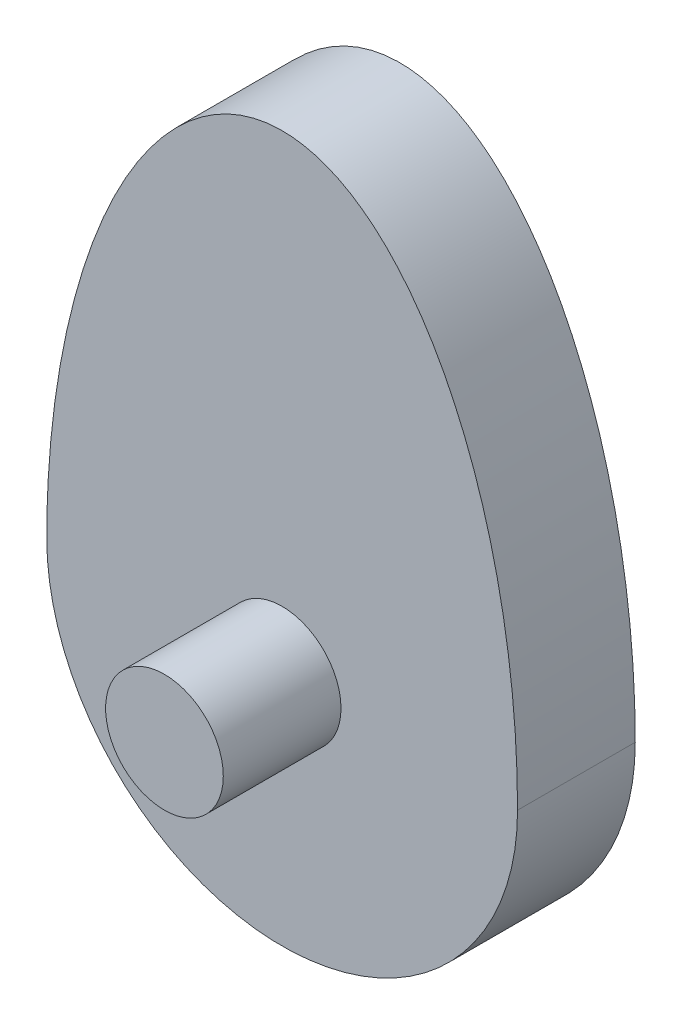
ISO-10303-21;
HEADER;
FILE_DESCRIPTION(('STEP AP214'),'2;1');
FILE_NAME('part.step','',(''),(''),'','','');
FILE_SCHEMA(('AUTOMOTIVE_DESIGN { 1 0 10303 214 1 1 1 1 }'));
ENDSEC;
DATA;
#1=APPLICATION_CONTEXT('core data for automotive mechanical design processes');
#2=APPLICATION_PROTOCOL_DEFINITION('international standard','automotive_design',2000,#1);
#3=PRODUCT_CONTEXT('',#1,'mechanical');
#4=PRODUCT('Part','Part','',(#3));
#5=PRODUCT_RELATED_PRODUCT_CATEGORY('part','',(#4));
#6=PRODUCT_DEFINITION_FORMATION('','',#4);
#7=PRODUCT_DEFINITION_CONTEXT('part definition',#1,'design');
#8=PRODUCT_DEFINITION('design','',#6,#7);
#9=PRODUCT_DEFINITION_SHAPE('','',#8);
#10=(LENGTH_UNIT() NAMED_UNIT(*) SI_UNIT(.MILLI.,.METRE.));
#11=(NAMED_UNIT(*) PLANE_ANGLE_UNIT() SI_UNIT($,.RADIAN.));
#12=(NAMED_UNIT(*) SI_UNIT($,.STERADIAN.) SOLID_ANGLE_UNIT());
#13=UNCERTAINTY_MEASURE_WITH_UNIT(LENGTH_MEASURE(1.E-05),#10,'distance_accuracy_value','');
#14=(GEOMETRIC_REPRESENTATION_CONTEXT(3) GLOBAL_UNCERTAINTY_ASSIGNED_CONTEXT((#13)) GLOBAL_UNIT_ASSIGNED_CONTEXT((#10,
#11,#12)) REPRESENTATION_CONTEXT('',''));
#15=CARTESIAN_POINT('',(0.,0.,0.));
#16=DIRECTION('',(0.,0.,1.));
#17=DIRECTION('',(1.,0.,0.));
#18=AXIS2_PLACEMENT_3D('',#15,#16,#17);
#19=CARTESIAN_POINT('',(0.,0.,20.));
#20=DIRECTION('',(0.,0.,1.));
#21=DIRECTION('',(1.,0.,0.));
#22=AXIS2_PLACEMENT_3D('',#19,#20,#21);
#23=PLANE('',#22);
#24=CARTESIAN_POINT('',(0.,0.,20.));
#25=DIRECTION('',(0.,0.,1.));
#26=DIRECTION('',(0.,1.,0.));
#27=AXIS2_PLACEMENT_3D('',#24,#25,#26);
#28=ELLIPSE('',#27,80.,40.);
#29=CARTESIAN_POINT('',(40.,0.,20.));
#30=VERTEX_POINT('',#29);
#31=CARTESIAN_POINT('',(-40.,0.,20.));
#32=VERTEX_POINT('',#31);
#33=EDGE_CURVE('E67',#30,#32,#28,.T.);
#34=ORIENTED_EDGE('',*,*,#33,.T.);
#35=CARTESIAN_POINT('',(0.,0.,20.));
#36=DIRECTION('',(0.,0.,1.));
#37=DIRECTION('',(1.,0.,0.));
#38=AXIS2_PLACEMENT_3D('',#35,#36,#37);
#39=CIRCLE('',#38,40.);
#40=EDGE_CURVE('E50',#32,#30,#39,.T.);
#41=ORIENTED_EDGE('',*,*,#40,.T.);
#42=EDGE_LOOP('',(#34,#41));
#43=FACE_BOUND('',#42,.T.);
#44=CARTESIAN_POINT('',(0.,0.,20.));
#45=DIRECTION('',(0.,0.,1.));
#46=DIRECTION('',(1.,0.,0.));
#47=AXIS2_PLACEMENT_3D('',#44,#45,#46);
#48=CIRCLE('',#47,10.);
#49=CARTESIAN_POINT('',(10.,0.,20.));
#50=VERTEX_POINT('',#49);
#51=EDGE_CURVE('E76',#50,#50,#48,.T.);
#52=ORIENTED_EDGE('',*,*,#51,.F.);
#53=EDGE_LOOP('',(#52));
#54=FACE_BOUND('',#53,.T.);
#55=ADVANCED_FACE('F33',(#43,#54),#23,.T.);
#56=DIRECTION('',(0.,0.,-1.));
#57=VECTOR('',#56,1.);
#58=SURFACE_OF_LINEAR_EXTRUSION('',#28,#57);
#59=CARTESIAN_POINT('',(0.,0.,0.));
#60=DIRECTION('',(0.,0.,1.));
#61=DIRECTION('',(0.,1.,0.));
#62=AXIS2_PLACEMENT_3D('',#59,#60,#61);
#63=ELLIPSE('',#62,80.,40.);
#64=CARTESIAN_POINT('',(40.,0.,0.));
#65=VERTEX_POINT('',#64);
#66=CARTESIAN_POINT('',(-40.,0.,0.));
#67=VERTEX_POINT('',#66);
#68=EDGE_CURVE('E68',#65,#67,#63,.T.);
#69=ORIENTED_EDGE('',*,*,#68,.T.);
#70=DIRECTION('',(0.,0.,-1.));
#71=VECTOR('',#70,1.);
#72=CARTESIAN_POINT('',(-40.,0.,20.));
#73=LINE('',#72,#71);
#74=EDGE_CURVE('E43',#32,#67,#73,.T.);
#75=ORIENTED_EDGE('',*,*,#74,.F.);
#76=ORIENTED_EDGE('',*,*,#33,.F.);
#77=DIRECTION('',(0.,0.,-1.));
#78=VECTOR('',#77,1.);
#79=CARTESIAN_POINT('',(40.,0.,20.));
#80=LINE('',#79,#78);
#81=EDGE_CURVE('E63',#30,#65,#80,.T.);
#82=ORIENTED_EDGE('',*,*,#81,.T.);
#83=EDGE_LOOP('',(#69,#75,#76,#82));
#84=FACE_BOUND('',#83,.T.);
#85=ADVANCED_FACE('F35',(#84),#58,.F.);
#86=CARTESIAN_POINT('',(0.,0.,20.));
#87=DIRECTION('',(0.,0.,-1.));
#88=DIRECTION('',(-1.,0.,0.));
#89=AXIS2_PLACEMENT_3D('',#86,#87,#88);
#90=CYLINDRICAL_SURFACE('',#89,40.);
#91=CARTESIAN_POINT('',(0.,0.,0.));
#92=DIRECTION('',(0.,0.,1.));
#93=DIRECTION('',(1.,0.,0.));
#94=AXIS2_PLACEMENT_3D('',#91,#92,#93);
#95=CIRCLE('',#94,40.);
#96=EDGE_CURVE('E58',#67,#65,#95,.T.);
#97=ORIENTED_EDGE('',*,*,#96,.T.);
#98=ORIENTED_EDGE('',*,*,#81,.F.);
#99=ORIENTED_EDGE('',*,*,#40,.F.);
#100=ORIENTED_EDGE('',*,*,#74,.T.);
#101=EDGE_LOOP('',(#97,#98,#99,#100));
#102=FACE_BOUND('',#101,.T.);
#103=ADVANCED_FACE('F62',(#102),#90,.T.);
#104=CARTESIAN_POINT('',(0.,0.,0.));
#105=DIRECTION('',(0.,0.,1.));
#106=DIRECTION('',(1.,0.,0.));
#107=AXIS2_PLACEMENT_3D('',#104,#105,#106);
#108=PLANE('',#107);
#109=CARTESIAN_POINT('',(0.,0.,0.));
#110=DIRECTION('',(0.,0.,1.));
#111=DIRECTION('',(1.,0.,0.));
#112=AXIS2_PLACEMENT_3D('',#109,#110,#111);
#113=CIRCLE('',#112,15.);
#114=CARTESIAN_POINT('',(15.,0.,0.));
#115=VERTEX_POINT('',#114);
#116=EDGE_CURVE('E11',#115,#115,#113,.F.);
#117=ORIENTED_EDGE('',*,*,#116,.F.);
#118=EDGE_LOOP('',(#117));
#119=FACE_BOUND('',#118,.T.);
#120=ORIENTED_EDGE('',*,*,#68,.F.);
#121=ORIENTED_EDGE('',*,*,#96,.F.);
#122=EDGE_LOOP('',(#120,#121));
#123=FACE_BOUND('',#122,.T.);
#124=ADVANCED_FACE('F72',(#119,#123),#108,.F.);
#125=CARTESIAN_POINT('',(0.,0.,40.));
#126=DIRECTION('',(0.,0.,-1.));
#127=DIRECTION('',(-1.,0.,0.));
#128=AXIS2_PLACEMENT_3D('',#125,#126,#127);
#129=CYLINDRICAL_SURFACE('',#128,10.);
#130=CARTESIAN_POINT('',(0.,0.,40.));
#131=DIRECTION('',(0.,0.,1.));
#132=DIRECTION('',(1.,0.,0.));
#133=AXIS2_PLACEMENT_3D('',#130,#131,#132);
#134=CIRCLE('',#133,10.);
#135=CARTESIAN_POINT('',(10.,0.,40.));
#136=VERTEX_POINT('',#135);
#137=EDGE_CURVE('E73',#136,#136,#134,.T.);
#138=ORIENTED_EDGE('',*,*,#137,.F.);
#139=EDGE_LOOP('',(#138));
#140=FACE_BOUND('',#139,.T.);
#141=ORIENTED_EDGE('',*,*,#51,.T.);
#142=EDGE_LOOP('',(#141));
#143=FACE_BOUND('',#142,.T.);
#144=ADVANCED_FACE('F108',(#140,#143),#129,.T.);
#145=CARTESIAN_POINT('',(0.,0.,40.));
#146=DIRECTION('',(0.,0.,1.));
#147=DIRECTION('',(1.,0.,0.));
#148=AXIS2_PLACEMENT_3D('',#145,#146,#147);
#149=PLANE('',#148);
#150=ORIENTED_EDGE('',*,*,#137,.T.);
#151=EDGE_LOOP('',(#150));
#152=FACE_BOUND('',#151,.T.);
#153=ADVANCED_FACE('F99',(#152),#149,.T.);
#154=CARTESIAN_POINT('',(0.,0.,-10.));
#155=DIRECTION('',(0.,0.,-1.));
#156=DIRECTION('',(-1.,0.,0.));
#157=AXIS2_PLACEMENT_3D('',#154,#155,#156);
#158=PLANE('',#157);
#159=CARTESIAN_POINT('',(0.,0.,-10.));
#160=DIRECTION('',(0.,0.,-1.));
#161=DIRECTION('',(-1.,0.,0.));
#162=AXIS2_PLACEMENT_3D('',#159,#160,#161);
#163=CIRCLE('',#162,15.);
#164=CARTESIAN_POINT('',(-15.,0.,-10.));
#165=VERTEX_POINT('',#164);
#166=EDGE_CURVE('E82',#165,#165,#163,.T.);
#167=ORIENTED_EDGE('',*,*,#166,.T.);
#168=EDGE_LOOP('',(#167));
#169=FACE_BOUND('',#168,.T.);
#170=CARTESIAN_POINT('',(0.,0.,-10.));
#171=DIRECTION('',(0.,0.,-1.));
#172=DIRECTION('',(-1.,0.,0.));
#173=AXIS2_PLACEMENT_3D('',#170,#171,#172);
#174=CIRCLE('',#173,5.);
#175=CARTESIAN_POINT('',(-5.,0.,-10.));
#176=VERTEX_POINT('',#175);
#177=EDGE_CURVE('E86',#176,#176,#174,.T.);
#178=ORIENTED_EDGE('',*,*,#177,.F.);
#179=EDGE_LOOP('',(#178));
#180=FACE_BOUND('',#179,.T.);
#181=ADVANCED_FACE('F96',(#169,#180),#158,.T.);
#182=CARTESIAN_POINT('',(0.,0.,-10.));
#183=DIRECTION('',(0.,0.,1.));
#184=DIRECTION('',(1.,0.,0.));
#185=AXIS2_PLACEMENT_3D('',#182,#183,#184);
#186=CYLINDRICAL_SURFACE('',#185,15.);
#187=ORIENTED_EDGE('',*,*,#166,.F.);
#188=EDGE_LOOP('',(#187));
#189=FACE_BOUND('',#188,.T.);
#190=ORIENTED_EDGE('',*,*,#116,.T.);
#191=EDGE_LOOP('',(#190));
#192=FACE_BOUND('',#191,.T.);
#193=ADVANCED_FACE('F98',(#189,#192),#186,.T.);
#194=CARTESIAN_POINT('',(0.,0.,-10.));
#195=DIRECTION('',(0.,0.,1.));
#196=DIRECTION('',(1.,0.,0.));
#197=AXIS2_PLACEMENT_3D('',#194,#195,#196);
#198=CYLINDRICAL_SURFACE('',#197,5.);
#199=ORIENTED_EDGE('',*,*,#177,.T.);
#200=EDGE_LOOP('',(#199));
#201=FACE_BOUND('',#200,.T.);
#202=CARTESIAN_POINT('',(0.,0.,0.));
#203=DIRECTION('',(0.,0.,-1.));
#204=DIRECTION('',(-1.,0.,0.));
#205=AXIS2_PLACEMENT_3D('',#202,#203,#204);
#206=CIRCLE('',#205,5.);
#207=CARTESIAN_POINT('',(-5.,0.,0.));
#208=VERTEX_POINT('',#207);
#209=EDGE_CURVE('E87',#208,#208,#206,.T.);
#210=ORIENTED_EDGE('',*,*,#209,.F.);
#211=EDGE_LOOP('',(#210));
#212=FACE_BOUND('',#211,.T.);
#213=ADVANCED_FACE('F93',(#201,#212),#198,.F.);
#214=ORIENTED_EDGE('',*,*,#209,.T.);
#215=EDGE_LOOP('',(#214));
#216=FACE_BOUND('',#215,.T.);
#217=ADVANCED_FACE('F122',(#216),#108,.F.);
#218=CLOSED_SHELL('',(#55,#85,#103,#124,#144,#153,#181,#193,#213,#217));
#219=MANIFOLD_SOLID_BREP('B2',#218);
#220=ADVANCED_BREP_SHAPE_REPRESENTATION('',(#18,#219),#14);
#221=SHAPE_DEFINITION_REPRESENTATION(#9,#220);
ENDSEC;
END-ISO-10303-21;
